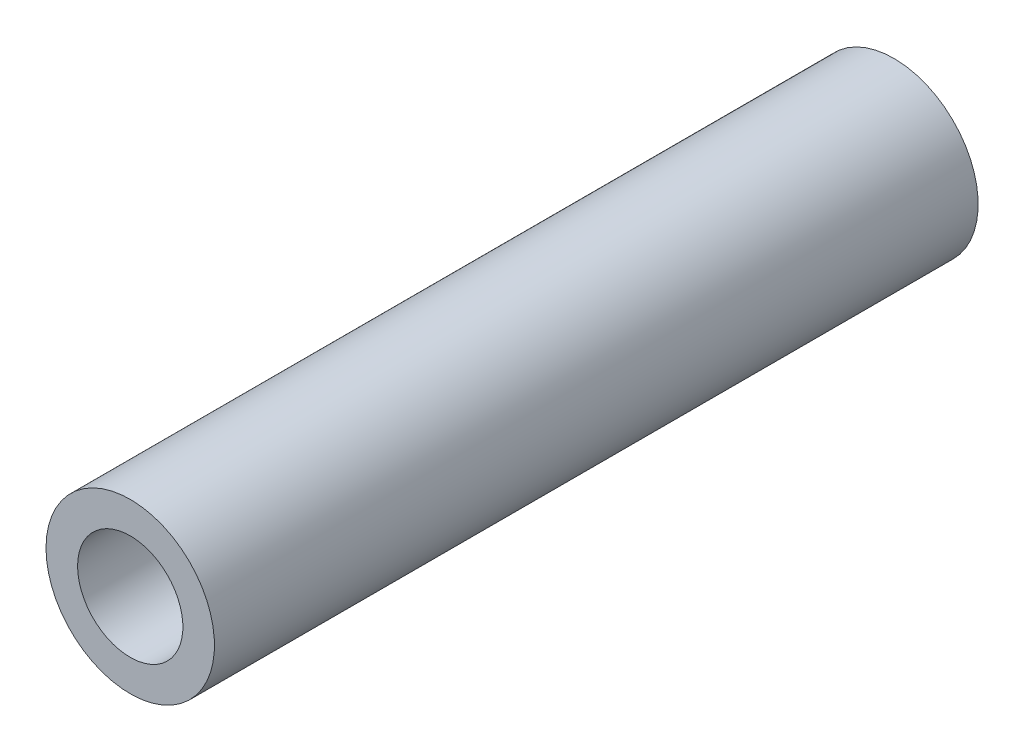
ISO-10303-21;
HEADER;
FILE_DESCRIPTION(('STEP AP214'),'2;1');
FILE_NAME('part.step','',(''),(''),'','','');
FILE_SCHEMA(('AUTOMOTIVE_DESIGN { 1 0 10303 214 1 1 1 1 }'));
ENDSEC;
DATA;
#1=APPLICATION_CONTEXT('core data for automotive mechanical design processes');
#2=APPLICATION_PROTOCOL_DEFINITION('international standard','automotive_design',2000,#1);
#3=PRODUCT_CONTEXT('',#1,'mechanical');
#4=PRODUCT('Part','Part','',(#3));
#5=PRODUCT_RELATED_PRODUCT_CATEGORY('part','',(#4));
#6=PRODUCT_DEFINITION_FORMATION('','',#4);
#7=PRODUCT_DEFINITION_CONTEXT('part definition',#1,'design');
#8=PRODUCT_DEFINITION('design','',#6,#7);
#9=PRODUCT_DEFINITION_SHAPE('','',#8);
#10=(LENGTH_UNIT() NAMED_UNIT(*) SI_UNIT(.MILLI.,.METRE.));
#11=(NAMED_UNIT(*) PLANE_ANGLE_UNIT() SI_UNIT($,.RADIAN.));
#12=(NAMED_UNIT(*) SI_UNIT($,.STERADIAN.) SOLID_ANGLE_UNIT());
#13=UNCERTAINTY_MEASURE_WITH_UNIT(LENGTH_MEASURE(1.E-05),#10,'distance_accuracy_value','');
#14=(GEOMETRIC_REPRESENTATION_CONTEXT(3) GLOBAL_UNCERTAINTY_ASSIGNED_CONTEXT((#13)) GLOBAL_UNIT_ASSIGNED_CONTEXT((#10,
#11,#12)) REPRESENTATION_CONTEXT('',''));
#15=CARTESIAN_POINT('',(0.,0.,0.));
#16=DIRECTION('',(0.,0.,1.));
#17=DIRECTION('',(1.,0.,0.));
#18=AXIS2_PLACEMENT_3D('',#15,#16,#17);
#19=CARTESIAN_POINT('',(0.,0.,36.27));
#20=DIRECTION('',(0.,0.,1.));
#21=DIRECTION('',(1.,0.,0.));
#22=AXIS2_PLACEMENT_3D('',#19,#20,#21);
#23=PLANE('',#22);
#24=CARTESIAN_POINT('',(0.,0.,36.27));
#25=DIRECTION('',(0.,0.,1.));
#26=DIRECTION('',(1.,0.,0.));
#27=AXIS2_PLACEMENT_3D('',#24,#25,#26);
#28=CIRCLE('',#27,4.);
#29=CARTESIAN_POINT('',(-4.,0.,36.27));
#30=VERTEX_POINT('',#29);
#31=EDGE_CURVE('E10',#30,#30,#28,.T.);
#32=ORIENTED_EDGE('',*,*,#31,.T.);
#33=EDGE_LOOP('',(#32));
#34=FACE_BOUND('',#33,.T.);
#35=CARTESIAN_POINT('',(0.,0.,36.27));
#36=DIRECTION('',(0.,0.,1.));
#37=DIRECTION('',(1.,0.,0.));
#38=AXIS2_PLACEMENT_3D('',#35,#36,#37);
#39=CIRCLE('',#38,2.5);
#40=CARTESIAN_POINT('',(-2.5,0.,36.27));
#41=VERTEX_POINT('',#40);
#42=EDGE_CURVE('E40',#41,#41,#39,.T.);
#43=ORIENTED_EDGE('',*,*,#42,.F.);
#44=EDGE_LOOP('',(#43));
#45=FACE_BOUND('',#44,.T.);
#46=ADVANCED_FACE('F29',(#34,#45),#23,.T.);
#47=CARTESIAN_POINT('',(0.,0.,0.));
#48=DIRECTION('',(0.,0.,1.));
#49=DIRECTION('',(1.,0.,0.));
#50=AXIS2_PLACEMENT_3D('',#47,#48,#49);
#51=PLANE('',#50);
#52=CARTESIAN_POINT('',(0.,0.,0.));
#53=DIRECTION('',(0.,0.,1.));
#54=DIRECTION('',(1.,0.,0.));
#55=AXIS2_PLACEMENT_3D('',#52,#53,#54);
#56=CIRCLE('',#55,4.);
#57=CARTESIAN_POINT('',(-3.99999999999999,0.,0.));
#58=VERTEX_POINT('',#57);
#59=EDGE_CURVE('E36',#58,#58,#56,.T.);
#60=ORIENTED_EDGE('',*,*,#59,.F.);
#61=EDGE_LOOP('',(#60));
#62=FACE_BOUND('',#61,.T.);
#63=CARTESIAN_POINT('',(0.,0.,0.));
#64=DIRECTION('',(0.,0.,1.));
#65=DIRECTION('',(1.,0.,0.));
#66=AXIS2_PLACEMENT_3D('',#63,#64,#65);
#67=CIRCLE('',#66,2.5);
#68=CARTESIAN_POINT('',(-2.49999999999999,0.,0.));
#69=VERTEX_POINT('',#68);
#70=EDGE_CURVE('E44',#69,#69,#67,.T.);
#71=ORIENTED_EDGE('',*,*,#70,.T.);
#72=EDGE_LOOP('',(#71));
#73=FACE_BOUND('',#72,.T.);
#74=ADVANCED_FACE('F50',(#62,#73),#51,.F.);
#75=CARTESIAN_POINT('',(0.,0.,36.27));
#76=DIRECTION('',(0.,0.,-1.));
#77=DIRECTION('',(-1.,0.,0.));
#78=AXIS2_PLACEMENT_3D('',#75,#76,#77);
#79=CYLINDRICAL_SURFACE('',#78,4.);
#80=CARTESIAN_POINT('',(-4.,0.,36.27));
#81=CARTESIAN_POINT('',(-4.,0.,35.8921875));
#82=CARTESIAN_POINT('',(-4.,0.,35.514375));
#83=CARTESIAN_POINT('',(-4.,0.,34.75875));
#84=CARTESIAN_POINT('',(-4.,0.,34.3809375));
#85=CARTESIAN_POINT('',(-4.,0.,33.6253125));
#86=CARTESIAN_POINT('',(-4.,0.,33.2475));
#87=CARTESIAN_POINT('',(-4.,0.,32.491875));
#88=CARTESIAN_POINT('',(-4.,0.,32.1140625));
#89=CARTESIAN_POINT('',(-4.,0.,31.3584375));
#90=CARTESIAN_POINT('',(-4.,0.,30.980625));
#91=CARTESIAN_POINT('',(-4.,0.,30.225));
#92=CARTESIAN_POINT('',(-4.,0.,29.8471875));
#93=CARTESIAN_POINT('',(-4.,0.,29.0915625));
#94=CARTESIAN_POINT('',(-4.,0.,28.71375));
#95=CARTESIAN_POINT('',(-4.,0.,27.958125));
#96=CARTESIAN_POINT('',(-4.,0.,27.5803125));
#97=CARTESIAN_POINT('',(-4.,0.,26.8246875));
#98=CARTESIAN_POINT('',(-4.,0.,26.446875));
#99=CARTESIAN_POINT('',(-4.,0.,25.69125));
#100=CARTESIAN_POINT('',(-4.,0.,25.3134375));
#101=CARTESIAN_POINT('',(-4.,0.,24.5578125));
#102=CARTESIAN_POINT('',(-4.,0.,24.18));
#103=CARTESIAN_POINT('',(-4.,0.,23.424375));
#104=CARTESIAN_POINT('',(-4.,0.,23.0465625));
#105=CARTESIAN_POINT('',(-4.,0.,22.2909375));
#106=CARTESIAN_POINT('',(-4.,0.,21.913125));
#107=CARTESIAN_POINT('',(-4.,0.,21.1575));
#108=CARTESIAN_POINT('',(-4.,0.,20.7796875));
#109=CARTESIAN_POINT('',(-4.,0.,20.0240625));
#110=CARTESIAN_POINT('',(-4.,0.,19.64625));
#111=CARTESIAN_POINT('',(-4.,0.,18.890625));
#112=CARTESIAN_POINT('',(-4.,0.,18.5128125));
#113=CARTESIAN_POINT('',(-4.,0.,17.7571875));
#114=CARTESIAN_POINT('',(-4.,0.,17.379375));
#115=CARTESIAN_POINT('',(-4.,0.,16.62375));
#116=CARTESIAN_POINT('',(-4.,0.,16.2459375));
#117=CARTESIAN_POINT('',(-4.,0.,15.4903125));
#118=CARTESIAN_POINT('',(-3.99999999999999,0.,15.1125));
#119=CARTESIAN_POINT('',(-3.99999999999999,0.,14.356875));
#120=CARTESIAN_POINT('',(-3.99999999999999,0.,13.9790625));
#121=CARTESIAN_POINT('',(-3.99999999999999,0.,13.2234375));
#122=CARTESIAN_POINT('',(-3.99999999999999,0.,12.845625));
#123=CARTESIAN_POINT('',(-3.99999999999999,0.,12.09));
#124=CARTESIAN_POINT('',(-3.99999999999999,0.,11.7121875));
#125=CARTESIAN_POINT('',(-3.99999999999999,0.,10.9565625));
#126=CARTESIAN_POINT('',(-3.99999999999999,0.,10.57875));
#127=CARTESIAN_POINT('',(-3.99999999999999,0.,9.82312499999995));
#128=CARTESIAN_POINT('',(-3.99999999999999,0.,9.44531249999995));
#129=CARTESIAN_POINT('',(-3.99999999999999,0.,8.68968749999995));
#130=CARTESIAN_POINT('',(-3.99999999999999,0.,8.31187499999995));
#131=CARTESIAN_POINT('',(-3.99999999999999,0.,7.55624999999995));
#132=CARTESIAN_POINT('',(-3.99999999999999,0.,7.17843749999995));
#133=CARTESIAN_POINT('',(-3.99999999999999,0.,6.42281249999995));
#134=CARTESIAN_POINT('',(-3.99999999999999,0.,6.04499999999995));
#135=CARTESIAN_POINT('',(-3.99999999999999,0.,5.28937499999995));
#136=CARTESIAN_POINT('',(-3.99999999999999,0.,4.91156249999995));
#137=CARTESIAN_POINT('',(-3.99999999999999,0.,4.15593749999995));
#138=CARTESIAN_POINT('',(-3.99999999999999,0.,3.77812499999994));
#139=CARTESIAN_POINT('',(-3.99999999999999,0.,3.02249999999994));
#140=CARTESIAN_POINT('',(-3.99999999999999,0.,2.64468749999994));
#141=CARTESIAN_POINT('',(-3.99999999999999,0.,1.88906249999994));
#142=CARTESIAN_POINT('',(-3.99999999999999,0.,1.51124999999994));
#143=CARTESIAN_POINT('',(-3.99999999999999,0.,0.755624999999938));
#144=CARTESIAN_POINT('',(-3.99999999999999,0.,0.377812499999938));
#145=CARTESIAN_POINT('',(-3.99999999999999,0.,0.));
#146=B_SPLINE_CURVE_WITH_KNOTS('',3,(#80,#81,#82,#83,#84,#85,#86,#87,#88,#89,#90,#91,#92,#93,
#94,#95,#96,#97,#98,#99,#100,#101,#102,#103,#104,#105,#106,#107,#108,#109,#110,#111,#112,#113,
#114,#115,#116,#117,#118,#119,#120,#121,#122,#123,#124,#125,#126,#127,#128,#129,#130,#131,#132,
#133,#134,#135,#136,#137,#138,#139,#140,#141,#142,#143,#144,#145),.UNSPECIFIED.,.F.,.F.,(4,2,2,
2,2,2,2,2,2,2,2,2,2,2,2,2,2,2,2,2,2,2,2,2,2,2,2,2,2,2,2,2,4),(0.,1.1334375,2.266875,3.4003125,
4.53375,5.6671875,6.80062500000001,7.9340625,9.06750000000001,10.2009375,11.334375,12.4678125,
13.60125,14.7346875,15.868125,17.0015625,18.135,19.2684375,20.401875,21.5353125,22.66875,
23.8021875,24.935625,26.0690625,27.2025,28.3359375,29.469375,30.6028125,31.73625,32.8696875,
34.0031250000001,35.1365625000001,36.2700000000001),.UNSPECIFIED.);
#147=EDGE_CURVE('BSEAM31',#30,#58,#146,.T.);
#148=ORIENTED_EDGE('',*,*,#31,.F.);
#149=ORIENTED_EDGE('',*,*,#59,.T.);
#150=ORIENTED_EDGE('',*,*,#147,.T.);
#151=ORIENTED_EDGE('',*,*,#147,.F.);
#152=EDGE_LOOP('',(#148,#150,#149,#151));
#153=FACE_BOUND('',#152,.T.);
#154=ADVANCED_FACE('F31',(#153),#79,.T.);
#155=CARTESIAN_POINT('',(0.,0.,36.27));
#156=DIRECTION('',(0.,0.,-1.));
#157=DIRECTION('',(-1.,0.,0.));
#158=AXIS2_PLACEMENT_3D('',#155,#156,#157);
#159=CYLINDRICAL_SURFACE('',#158,2.5);
#160=CARTESIAN_POINT('',(-2.5,0.,36.27));
#161=CARTESIAN_POINT('',(-2.5,0.,35.8921875));
#162=CARTESIAN_POINT('',(-2.5,0.,35.514375));
#163=CARTESIAN_POINT('',(-2.5,0.,34.75875));
#164=CARTESIAN_POINT('',(-2.5,0.,34.3809375));
#165=CARTESIAN_POINT('',(-2.5,0.,33.6253125));
#166=CARTESIAN_POINT('',(-2.5,0.,33.2475));
#167=CARTESIAN_POINT('',(-2.5,0.,32.491875));
#168=CARTESIAN_POINT('',(-2.5,0.,32.1140625));
#169=CARTESIAN_POINT('',(-2.5,0.,31.3584375));
#170=CARTESIAN_POINT('',(-2.5,0.,30.980625));
#171=CARTESIAN_POINT('',(-2.5,0.,30.225));
#172=CARTESIAN_POINT('',(-2.5,0.,29.8471875));
#173=CARTESIAN_POINT('',(-2.5,0.,29.0915625));
#174=CARTESIAN_POINT('',(-2.5,0.,28.71375));
#175=CARTESIAN_POINT('',(-2.5,0.,27.958125));
#176=CARTESIAN_POINT('',(-2.5,0.,27.5803125));
#177=CARTESIAN_POINT('',(-2.5,0.,26.8246875));
#178=CARTESIAN_POINT('',(-2.5,0.,26.446875));
#179=CARTESIAN_POINT('',(-2.5,0.,25.69125));
#180=CARTESIAN_POINT('',(-2.5,0.,25.3134375));
#181=CARTESIAN_POINT('',(-2.5,0.,24.5578125));
#182=CARTESIAN_POINT('',(-2.5,0.,24.18));
#183=CARTESIAN_POINT('',(-2.5,0.,23.424375));
#184=CARTESIAN_POINT('',(-2.5,0.,23.0465625));
#185=CARTESIAN_POINT('',(-2.5,0.,22.2909375));
#186=CARTESIAN_POINT('',(-2.5,0.,21.913125));
#187=CARTESIAN_POINT('',(-2.5,0.,21.1575));
#188=CARTESIAN_POINT('',(-2.5,0.,20.7796875));
#189=CARTESIAN_POINT('',(-2.5,0.,20.0240625));
#190=CARTESIAN_POINT('',(-2.5,0.,19.64625));
#191=CARTESIAN_POINT('',(-2.5,0.,18.890625));
#192=CARTESIAN_POINT('',(-2.5,0.,18.5128125));
#193=CARTESIAN_POINT('',(-2.5,0.,17.7571875));
#194=CARTESIAN_POINT('',(-2.5,0.,17.379375));
#195=CARTESIAN_POINT('',(-2.5,0.,16.62375));
#196=CARTESIAN_POINT('',(-2.5,0.,16.2459375));
#197=CARTESIAN_POINT('',(-2.5,0.,15.4903125));
#198=CARTESIAN_POINT('',(-2.5,0.,15.1125));
#199=CARTESIAN_POINT('',(-2.5,0.,14.356875));
#200=CARTESIAN_POINT('',(-2.49999999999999,0.,13.9790625));
#201=CARTESIAN_POINT('',(-2.49999999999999,0.,13.2234375));
#202=CARTESIAN_POINT('',(-2.49999999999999,0.,12.845625));
#203=CARTESIAN_POINT('',(-2.49999999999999,0.,12.09));
#204=CARTESIAN_POINT('',(-2.49999999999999,0.,11.7121875));
#205=CARTESIAN_POINT('',(-2.49999999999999,0.,10.9565625));
#206=CARTESIAN_POINT('',(-2.49999999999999,0.,10.57875));
#207=CARTESIAN_POINT('',(-2.49999999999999,0.,9.82312499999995));
#208=CARTESIAN_POINT('',(-2.49999999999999,0.,9.44531249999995));
#209=CARTESIAN_POINT('',(-2.49999999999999,0.,8.68968749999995));
#210=CARTESIAN_POINT('',(-2.49999999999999,0.,8.31187499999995));
#211=CARTESIAN_POINT('',(-2.49999999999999,0.,7.55624999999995));
#212=CARTESIAN_POINT('',(-2.49999999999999,0.,7.17843749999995));
#213=CARTESIAN_POINT('',(-2.49999999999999,0.,6.42281249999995));
#214=CARTESIAN_POINT('',(-2.49999999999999,0.,6.04499999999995));
#215=CARTESIAN_POINT('',(-2.49999999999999,0.,5.28937499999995));
#216=CARTESIAN_POINT('',(-2.49999999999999,0.,4.91156249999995));
#217=CARTESIAN_POINT('',(-2.49999999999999,0.,4.15593749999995));
#218=CARTESIAN_POINT('',(-2.49999999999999,0.,3.77812499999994));
#219=CARTESIAN_POINT('',(-2.49999999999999,0.,3.02249999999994));
#220=CARTESIAN_POINT('',(-2.49999999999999,0.,2.64468749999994));
#221=CARTESIAN_POINT('',(-2.49999999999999,0.,1.88906249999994));
#222=CARTESIAN_POINT('',(-2.49999999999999,0.,1.51124999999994));
#223=CARTESIAN_POINT('',(-2.49999999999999,0.,0.755624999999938));
#224=CARTESIAN_POINT('',(-2.49999999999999,0.,0.377812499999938));
#225=CARTESIAN_POINT('',(-2.49999999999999,0.,0.));
#226=B_SPLINE_CURVE_WITH_KNOTS('',3,(#160,#161,#162,#163,#164,#165,#166,#167,#168,#169,#170,
#171,#172,#173,#174,#175,#176,#177,#178,#179,#180,#181,#182,#183,#184,#185,#186,#187,#188,#189,
#190,#191,#192,#193,#194,#195,#196,#197,#198,#199,#200,#201,#202,#203,#204,#205,#206,#207,#208,
#209,#210,#211,#212,#213,#214,#215,#216,#217,#218,#219,#220,#221,#222,#223,#224,#225),
.UNSPECIFIED.,.F.,.F.,(4,2,2,2,2,2,2,2,2,2,2,2,2,2,2,2,2,2,2,2,2,2,2,2,2,2,2,2,2,2,2,2,4),(0.,
1.1334375,2.266875,3.4003125,4.53375,5.6671875,6.80062500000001,7.9340625,9.06750000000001,
10.2009375,11.334375,12.4678125,13.60125,14.7346875,15.868125,17.0015625,18.135,19.2684375,
20.401875,21.5353125,22.66875,23.8021875,24.935625,26.0690625,27.2025,28.3359375,29.469375,
30.6028125,31.73625,32.8696875,34.0031250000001,35.1365625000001,36.2700000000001),.UNSPECIFIED.);
#227=EDGE_CURVE('BSEAM52',#41,#69,#226,.T.);
#228=ORIENTED_EDGE('',*,*,#42,.T.);
#229=ORIENTED_EDGE('',*,*,#70,.F.);
#230=ORIENTED_EDGE('',*,*,#227,.T.);
#231=ORIENTED_EDGE('',*,*,#227,.F.);
#232=EDGE_LOOP('',(#228,#230,#229,#231));
#233=FACE_BOUND('',#232,.T.);
#234=ADVANCED_FACE('F52',(#233),#159,.F.);
#235=CLOSED_SHELL('',(#46,#74,#154,#234));
#236=MANIFOLD_SOLID_BREP('B2',#235);
#237=ADVANCED_BREP_SHAPE_REPRESENTATION('',(#18,#236),#14);
#238=SHAPE_DEFINITION_REPRESENTATION(#9,#237);
ENDSEC;
END-ISO-10303-21;
